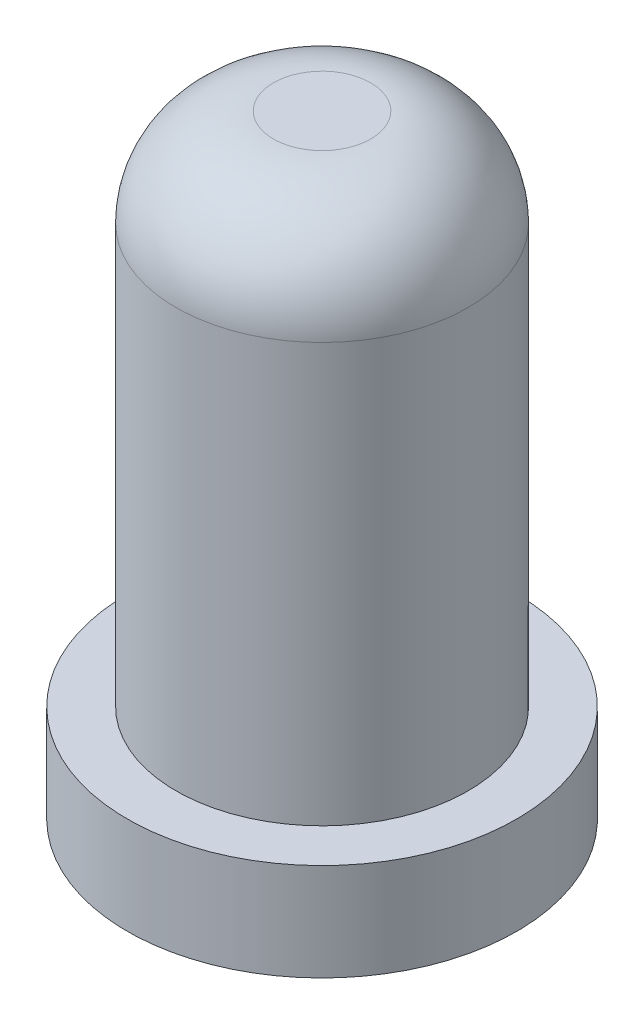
ISO-10303-21;
HEADER;
FILE_DESCRIPTION(('STEP AP214'),'2;1');
FILE_NAME('part.step','',(''),(''),'','','');
FILE_SCHEMA(('AUTOMOTIVE_DESIGN { 1 0 10303 214 1 1 1 1 }'));
ENDSEC;
DATA;
#1=APPLICATION_CONTEXT('core data for automotive mechanical design processes');
#2=APPLICATION_PROTOCOL_DEFINITION('international standard','automotive_design',2000,#1);
#3=PRODUCT_CONTEXT('',#1,'mechanical');
#4=PRODUCT('Part','Part','',(#3));
#5=PRODUCT_RELATED_PRODUCT_CATEGORY('part','',(#4));
#6=PRODUCT_DEFINITION_FORMATION('','',#4);
#7=PRODUCT_DEFINITION_CONTEXT('part definition',#1,'design');
#8=PRODUCT_DEFINITION('design','',#6,#7);
#9=PRODUCT_DEFINITION_SHAPE('','',#8);
#10=(LENGTH_UNIT() NAMED_UNIT(*) SI_UNIT(.MILLI.,.METRE.));
#11=(NAMED_UNIT(*) PLANE_ANGLE_UNIT() SI_UNIT($,.RADIAN.));
#12=(NAMED_UNIT(*) SI_UNIT($,.STERADIAN.) SOLID_ANGLE_UNIT());
#13=UNCERTAINTY_MEASURE_WITH_UNIT(LENGTH_MEASURE(1.E-05),#10,'distance_accuracy_value','');
#14=(GEOMETRIC_REPRESENTATION_CONTEXT(3) GLOBAL_UNCERTAINTY_ASSIGNED_CONTEXT((#13)) GLOBAL_UNIT_ASSIGNED_CONTEXT((#10,
#11,#12)) REPRESENTATION_CONTEXT('',''));
#15=CARTESIAN_POINT('',(0.,0.,0.));
#16=DIRECTION('',(0.,0.,1.));
#17=DIRECTION('',(1.,0.,0.));
#18=AXIS2_PLACEMENT_3D('',#15,#16,#17);
#19=CARTESIAN_POINT('',(-0.75,0.,0.));
#20=DIRECTION('',(0.,1.,0.));
#21=DIRECTION('',(0.,0.,1.));
#22=AXIS2_PLACEMENT_3D('',#19,#20,#21);
#23=PLANE('',#22);
#24=CARTESIAN_POINT('',(0.,0.,0.));
#25=DIRECTION('',(0.,-1.,0.));
#26=DIRECTION('',(0.,0.,-1.));
#27=AXIS2_PLACEMENT_3D('',#24,#25,#26);
#28=CIRCLE('',#27,0.75);
#29=CARTESIAN_POINT('',(0.,0.,-0.75));
#30=VERTEX_POINT('',#29);
#31=EDGE_CURVE('E68',#30,#30,#28,.T.);
#32=ORIENTED_EDGE('',*,*,#31,.T.);
#33=EDGE_LOOP('',(#32));
#34=FACE_BOUND('',#33,.T.);
#35=ADVANCED_FACE('F37',(#34),#23,.F.);
#36=CARTESIAN_POINT('',(0.,3.,0.));
#37=DIRECTION('',(0.,-1.,0.));
#38=DIRECTION('',(0.,0.,-1.));
#39=AXIS2_PLACEMENT_3D('',#36,#37,#38);
#40=PLANE('',#39);
#41=CARTESIAN_POINT('',(0.,3.,0.));
#42=DIRECTION('',(0.,-1.,0.));
#43=DIRECTION('',(0.,0.,-1.));
#44=AXIS2_PLACEMENT_3D('',#41,#42,#43);
#45=CIRCLE('',#44,0.25);
#46=CARTESIAN_POINT('',(0.,3.,-0.25));
#47=VERTEX_POINT('',#46);
#48=EDGE_CURVE('E10',#47,#47,#45,.T.);
#49=ORIENTED_EDGE('',*,*,#48,.F.);
#50=EDGE_LOOP('',(#49));
#51=FACE_BOUND('',#50,.T.);
#52=ADVANCED_FACE('F105',(#51),#40,.F.);
#53=CARTESIAN_POINT('',(0.,2.5,0.));
#54=DIRECTION('',(0.,-1.,0.));
#55=DIRECTION('',(0.,0.,-1.));
#56=AXIS2_PLACEMENT_3D('',#53,#54,#55);
#57=DEGENERATE_TOROIDAL_SURFACE('',#56,0.25,0.5,.T.);
#58=CARTESIAN_POINT('',(0.,2.5,0.));
#59=DIRECTION('',(0.,-1.,0.));
#60=DIRECTION('',(0.,0.,-1.));
#61=AXIS2_PLACEMENT_3D('',#58,#59,#60);
#62=CIRCLE('',#61,0.750000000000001);
#63=CARTESIAN_POINT('',(0.,2.5,-0.750000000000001));
#64=VERTEX_POINT('',#63);
#65=EDGE_CURVE('E44',#64,#64,#62,.T.);
#66=ORIENTED_EDGE('',*,*,#65,.F.);
#67=EDGE_LOOP('',(#66));
#68=FACE_BOUND('',#67,.T.);
#69=ORIENTED_EDGE('',*,*,#48,.T.);
#70=EDGE_LOOP('',(#69));
#71=FACE_BOUND('',#70,.T.);
#72=ADVANCED_FACE('F100',(#68,#71),#57,.T.);
#73=CARTESIAN_POINT('',(0.,0.,0.));
#74=DIRECTION('',(0.,-1.,0.));
#75=DIRECTION('',(0.,0.,-1.));
#76=AXIS2_PLACEMENT_3D('',#73,#74,#75);
#77=CYLINDRICAL_SURFACE('',#76,0.75);
#78=CARTESIAN_POINT('',(0.,0.35,0.));
#79=DIRECTION('',(0.,-1.,0.));
#80=DIRECTION('',(0.,0.,-1.));
#81=AXIS2_PLACEMENT_3D('',#78,#79,#80);
#82=CIRCLE('',#81,0.75);
#83=CARTESIAN_POINT('',(0.,0.35,-0.75));
#84=VERTEX_POINT('',#83);
#85=EDGE_CURVE('E49',#84,#84,#82,.T.);
#86=ORIENTED_EDGE('',*,*,#85,.F.);
#87=EDGE_LOOP('',(#86));
#88=FACE_BOUND('',#87,.T.);
#89=ORIENTED_EDGE('',*,*,#65,.T.);
#90=EDGE_LOOP('',(#89));
#91=FACE_BOUND('',#90,.T.);
#92=ADVANCED_FACE('F95',(#88,#91),#77,.T.);
#93=CARTESIAN_POINT('',(-0.75,0.35,0.));
#94=DIRECTION('',(0.,-1.,0.));
#95=DIRECTION('',(0.,0.,-1.));
#96=AXIS2_PLACEMENT_3D('',#93,#94,#95);
#97=PLANE('',#96);
#98=CARTESIAN_POINT('',(0.,0.35,0.));
#99=DIRECTION('',(0.,-1.,0.));
#100=DIRECTION('',(0.,0.,-1.));
#101=AXIS2_PLACEMENT_3D('',#98,#99,#100);
#102=CIRCLE('',#101,1.);
#103=CARTESIAN_POINT('',(0.,0.35,-1.));
#104=VERTEX_POINT('',#103);
#105=EDGE_CURVE('E54',#104,#104,#102,.T.);
#106=ORIENTED_EDGE('',*,*,#105,.F.);
#107=EDGE_LOOP('',(#106));
#108=FACE_BOUND('',#107,.T.);
#109=ORIENTED_EDGE('',*,*,#85,.T.);
#110=EDGE_LOOP('',(#109));
#111=FACE_BOUND('',#110,.T.);
#112=ADVANCED_FACE('F89',(#108,#111),#97,.F.);
#113=CARTESIAN_POINT('',(0.,0.,0.));
#114=DIRECTION('',(0.,-1.,0.));
#115=DIRECTION('',(0.,0.,-1.));
#116=AXIS2_PLACEMENT_3D('',#113,#114,#115);
#117=CYLINDRICAL_SURFACE('',#116,1.);
#118=CARTESIAN_POINT('',(0.,-0.15,0.));
#119=DIRECTION('',(0.,-1.,0.));
#120=DIRECTION('',(0.,0.,-1.));
#121=AXIS2_PLACEMENT_3D('',#118,#119,#120);
#122=CIRCLE('',#121,1.);
#123=CARTESIAN_POINT('',(0.,-0.15,-1.));
#124=VERTEX_POINT('',#123);
#125=EDGE_CURVE('E60',#124,#124,#122,.T.);
#126=ORIENTED_EDGE('',*,*,#125,.F.);
#127=EDGE_LOOP('',(#126));
#128=FACE_BOUND('',#127,.T.);
#129=ORIENTED_EDGE('',*,*,#105,.T.);
#130=EDGE_LOOP('',(#129));
#131=FACE_BOUND('',#130,.T.);
#132=ADVANCED_FACE('F83',(#128,#131),#117,.T.);
#133=CARTESIAN_POINT('',(-1.,-0.15,0.));
#134=DIRECTION('',(0.,1.,0.));
#135=DIRECTION('',(0.,0.,1.));
#136=AXIS2_PLACEMENT_3D('',#133,#134,#135);
#137=PLANE('',#136);
#138=CARTESIAN_POINT('',(0.,-0.15,0.));
#139=DIRECTION('',(0.,-1.,0.));
#140=DIRECTION('',(0.,0.,-1.));
#141=AXIS2_PLACEMENT_3D('',#138,#139,#140);
#142=CIRCLE('',#141,0.75);
#143=CARTESIAN_POINT('',(0.,-0.15,-0.75));
#144=VERTEX_POINT('',#143);
#145=EDGE_CURVE('E64',#144,#144,#142,.T.);
#146=ORIENTED_EDGE('',*,*,#145,.F.);
#147=EDGE_LOOP('',(#146));
#148=FACE_BOUND('',#147,.T.);
#149=ORIENTED_EDGE('',*,*,#125,.T.);
#150=EDGE_LOOP('',(#149));
#151=FACE_BOUND('',#150,.T.);
#152=ADVANCED_FACE('F77',(#148,#151),#137,.F.);
#153=CARTESIAN_POINT('',(0.,0.,0.));
#154=DIRECTION('',(0.,-1.,0.));
#155=DIRECTION('',(0.,0.,-1.));
#156=AXIS2_PLACEMENT_3D('',#153,#154,#155);
#157=CYLINDRICAL_SURFACE('',#156,0.75);
#158=ORIENTED_EDGE('',*,*,#31,.F.);
#159=EDGE_LOOP('',(#158));
#160=FACE_BOUND('',#159,.T.);
#161=ORIENTED_EDGE('',*,*,#145,.T.);
#162=EDGE_LOOP('',(#161));
#163=FACE_BOUND('',#162,.T.);
#164=ADVANCED_FACE('F74',(#160,#163),#157,.F.);
#165=CLOSED_SHELL('',(#35,#52,#72,#92,#112,#132,#152,#164));
#166=MANIFOLD_SOLID_BREP('B2',#165);
#167=ADVANCED_BREP_SHAPE_REPRESENTATION('',(#18,#166),#14);
#168=SHAPE_DEFINITION_REPRESENTATION(#9,#167);
ENDSEC;
END-ISO-10303-21;
